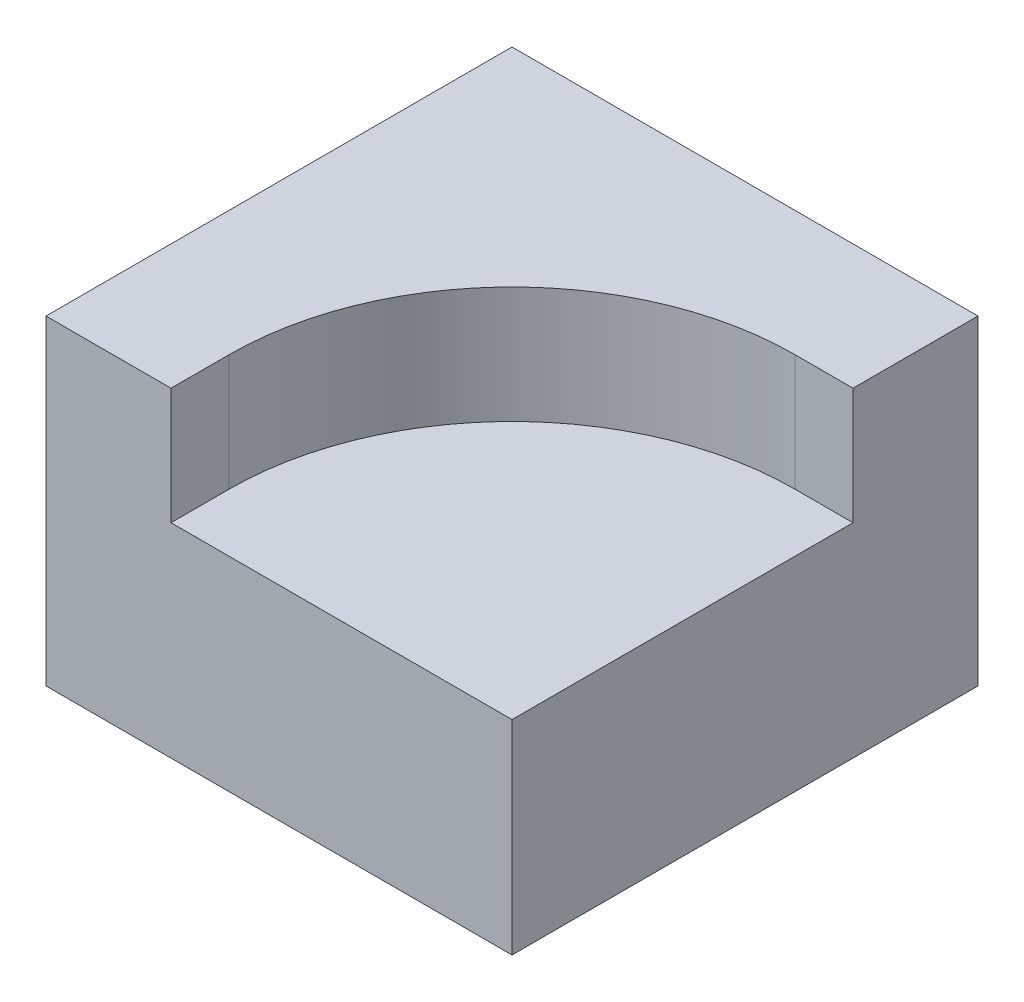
from build123d import *

# Parameters (mm, degrees)
SKETCH1_W          = 101.6
SKETCH1_H          = 101.6
EXTRUDE1_DEPTH     = 69.85
CUT_EXTRUDE1_DEPTH = 25.4


with BuildPart() as part:
    # Sketch1 → Extrude1 (new body)
    with BuildSketch(Plane(origin=(0, 0, 0), x_dir=(1, 0, 0), z_dir=(0, 1, 0))):
        with Locations((50.8, 50.8)):
            Rectangle(SKETCH1_W, SKETCH1_H)
    extrude(amount=EXTRUDE1_DEPTH)

    # Sketch2 → Cut-Extrude1 (cut)
    with BuildSketch(Plane(origin=(0, 69.85, 0), x_dir=(-1, 0, 0), z_dir=(0, 1, 0))):
        with BuildLine():
            Line((-101.6, -74.352133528), (-88.905322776, -74.352133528))
            ThreePointArc((-88.905322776, -74.352133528), (-45.310681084, -56.294641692), (-27.253189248, -12.7))
            Line((-27.253189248, -12.7), (-27.253189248, 0))
            Line((-27.253189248, 0), (-101.6, 0))
            Line((-101.6, 0), (-101.6, -74.352133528))
        make_face()
    extrude(amount=-CUT_EXTRUDE1_DEPTH, mode=Mode.SUBTRACT)


solid = part.part
